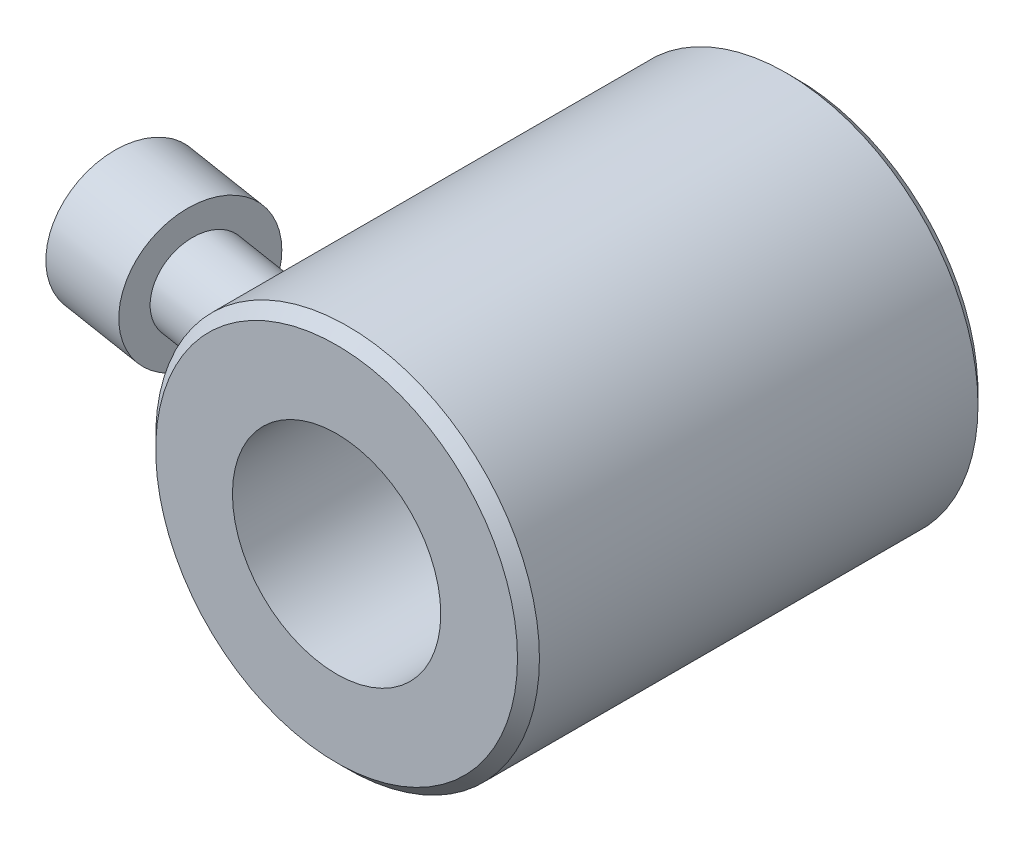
ISO-10303-21;
HEADER;
FILE_DESCRIPTION(('STEP AP214'),'2;1');
FILE_NAME('part.step','',(''),(''),'','','');
FILE_SCHEMA(('AUTOMOTIVE_DESIGN { 1 0 10303 214 1 1 1 1 }'));
ENDSEC;
DATA;
#1=APPLICATION_CONTEXT('core data for automotive mechanical design processes');
#2=APPLICATION_PROTOCOL_DEFINITION('international standard','automotive_design',2000,#1);
#3=PRODUCT_CONTEXT('',#1,'mechanical');
#4=PRODUCT('Part','Part','',(#3));
#5=PRODUCT_RELATED_PRODUCT_CATEGORY('part','',(#4));
#6=PRODUCT_DEFINITION_FORMATION('','',#4);
#7=PRODUCT_DEFINITION_CONTEXT('part definition',#1,'design');
#8=PRODUCT_DEFINITION('design','',#6,#7);
#9=PRODUCT_DEFINITION_SHAPE('','',#8);
#10=(LENGTH_UNIT() NAMED_UNIT(*) SI_UNIT(.MILLI.,.METRE.));
#11=(NAMED_UNIT(*) PLANE_ANGLE_UNIT() SI_UNIT($,.RADIAN.));
#12=(NAMED_UNIT(*) SI_UNIT($,.STERADIAN.) SOLID_ANGLE_UNIT());
#13=UNCERTAINTY_MEASURE_WITH_UNIT(LENGTH_MEASURE(1.E-05),#10,'distance_accuracy_value','');
#14=(GEOMETRIC_REPRESENTATION_CONTEXT(3) GLOBAL_UNCERTAINTY_ASSIGNED_CONTEXT((#13)) GLOBAL_UNIT_ASSIGNED_CONTEXT((#10,
#11,#12)) REPRESENTATION_CONTEXT('',''));
#15=CARTESIAN_POINT('',(0.,0.,0.));
#16=DIRECTION('',(0.,0.,1.));
#17=DIRECTION('',(1.,0.,0.));
#18=AXIS2_PLACEMENT_3D('',#15,#16,#17);
#19=CARTESIAN_POINT('',(-24.5233400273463,0.,8.88761222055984));
#20=DIRECTION('',(-0.987688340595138,0.,-0.156434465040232));
#21=DIRECTION('',(-0.156434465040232,0.,0.987688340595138));
#22=AXIS2_PLACEMENT_3D('',#19,#20,#21);
#23=CYLINDRICAL_SURFACE('',#22,1.25);
#24=CARTESIAN_POINT('',(-17.5,0.,11.265581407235));
#25=CARTESIAN_POINT('',(-17.4999994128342,0.0699765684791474,11.2655783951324));
#26=CARTESIAN_POINT('',(-17.499575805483,0.140001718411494,11.2596792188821));
#27=CARTESIAN_POINT('',(-17.4979265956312,0.278119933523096,11.2362271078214));
#28=CARTESIAN_POINT('',(-17.4967000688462,0.346210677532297,11.2186607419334));
#29=CARTESIAN_POINT('',(-17.493583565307,0.478441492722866,11.1723706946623));
#30=CARTESIAN_POINT('',(-17.491693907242,0.542583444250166,11.1436523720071));
#31=CARTESIAN_POINT('',(-17.4874637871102,0.665111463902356,11.0758775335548));
#32=CARTESIAN_POINT('',(-17.4851234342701,0.723498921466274,11.0368235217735));
#33=CARTESIAN_POINT('',(-17.4802526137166,0.832932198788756,10.9494526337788));
#34=CARTESIAN_POINT('',(-17.4777220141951,0.883972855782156,10.901129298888));
#35=CARTESIAN_POINT('',(-17.4727554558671,0.977243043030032,10.7966139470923));
#36=CARTESIAN_POINT('',(-17.4703195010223,1.01947220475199,10.7404216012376));
#37=CARTESIAN_POINT('',(-17.4658062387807,1.09408364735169,10.6215850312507));
#38=CARTESIAN_POINT('',(-17.4637300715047,1.1264348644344,10.5589212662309));
#39=CARTESIAN_POINT('',(-17.4601750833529,1.18026163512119,10.4290713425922));
#40=CARTESIAN_POINT('',(-17.458696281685,1.20173683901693,10.3618850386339));
#41=CARTESIAN_POINT('',(-17.4564876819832,1.23340768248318,10.22434920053));
#42=CARTESIAN_POINT('',(-17.4557637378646,1.24351521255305,10.1539792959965));
#43=CARTESIAN_POINT('',(-17.455160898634,1.25194887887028,10.0125341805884));
#44=CARTESIAN_POINT('',(-17.4552820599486,1.25027422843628,9.94145892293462));
#45=CARTESIAN_POINT('',(-17.456357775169,1.23516416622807,9.7997397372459));
#46=CARTESIAN_POINT('',(-17.4573220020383,1.22159224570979,9.72911043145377));
#47=CARTESIAN_POINT('',(-17.4599852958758,1.18291416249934,9.59109593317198));
#48=CARTESIAN_POINT('',(-17.4616844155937,1.15780717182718,9.52371097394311));
#49=CARTESIAN_POINT('',(-17.4656428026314,1.09648060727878,9.39349963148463));
#50=CARTESIAN_POINT('',(-17.467906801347,1.06016652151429,9.33071786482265));
#51=CARTESIAN_POINT('',(-17.4727286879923,0.977477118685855,9.21217909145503));
#52=CARTESIAN_POINT('',(-17.4752865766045,0.931101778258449,9.15642210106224));
#53=CARTESIAN_POINT('',(-17.4803911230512,0.829749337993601,9.05382068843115));
#54=CARTESIAN_POINT('',(-17.4829377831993,0.774808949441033,9.00694003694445));
#55=CARTESIAN_POINT('',(-17.4877346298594,0.65769619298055,8.9232805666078));
#56=CARTESIAN_POINT('',(-17.4899848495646,0.595524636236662,8.88650061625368));
#57=CARTESIAN_POINT('',(-17.4938841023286,0.466979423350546,8.82486405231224));
#58=CARTESIAN_POINT('',(-17.4955438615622,0.400709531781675,8.79979180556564));
#59=CARTESIAN_POINT('',(-17.498127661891,0.264837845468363,8.76139083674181));
#60=CARTESIAN_POINT('',(-17.4990518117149,0.195236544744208,8.74806037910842));
#61=CARTESIAN_POINT('',(-17.5000442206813,0.056317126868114,8.73376570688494));
#62=CARTESIAN_POINT('',(-17.5001308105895,-0.0129737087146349,8.73253663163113));
#63=CARTESIAN_POINT('',(-17.4994862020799,-0.150760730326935,8.74179567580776));
#64=CARTESIAN_POINT('',(-17.4987550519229,-0.219256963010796,8.75228310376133));
#65=CARTESIAN_POINT('',(-17.4965662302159,-0.353009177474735,8.78450143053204));
#66=CARTESIAN_POINT('',(-17.495113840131,-0.418284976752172,8.80615063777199));
#67=CARTESIAN_POINT('',(-17.4916459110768,-0.544337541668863,8.85994605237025));
#68=CARTESIAN_POINT('',(-17.4896303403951,-0.605114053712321,8.8920928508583));
#69=CARTESIAN_POINT('',(-17.4852257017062,-0.721326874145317,8.96638177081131));
#70=CARTESIAN_POINT('',(-17.482832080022,-0.77668264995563,9.00864950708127));
#71=CARTESIAN_POINT('',(-17.4779512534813,-0.879707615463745,9.1016897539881));
#72=CARTESIAN_POINT('',(-17.4754640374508,-0.927375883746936,9.15246328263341));
#73=CARTESIAN_POINT('',(-17.4706071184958,-1.01481668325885,9.26232481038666));
#74=CARTESIAN_POINT('',(-17.4682413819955,-1.05438466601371,9.32157583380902));
#75=CARTESIAN_POINT('',(-17.4639515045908,-1.12320577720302,9.44580882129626));
#76=CARTESIAN_POINT('',(-17.4620274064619,-1.15245790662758,9.51079133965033));
#77=CARTESIAN_POINT('',(-17.4588083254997,-1.20024948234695,9.64576831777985));
#78=CARTESIAN_POINT('',(-17.4575238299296,-1.21861123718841,9.71582603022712));
#79=CARTESIAN_POINT('',(-17.4557794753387,-1.24334983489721,9.85803888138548));
#80=CARTESIAN_POINT('',(-17.4553196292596,-1.24972648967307,9.93019405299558));
#81=CARTESIAN_POINT('',(-17.4552817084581,-1.25025635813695,10.074589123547));
#82=CARTESIAN_POINT('',(-17.4557040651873,-1.24440359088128,10.1468290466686));
#83=CARTESIAN_POINT('',(-17.4573880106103,-1.22055111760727,10.2892664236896));
#84=CARTESIAN_POINT('',(-17.4586495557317,-1.20255204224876,10.359463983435));
#85=CARTESIAN_POINT('',(-17.4618527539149,-1.15509903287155,10.4950465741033));
#86=CARTESIAN_POINT('',(-17.4637872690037,-1.12576497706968,10.5604737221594));
#87=CARTESIAN_POINT('',(-17.468118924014,-1.05641964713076,10.6853819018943));
#88=CARTESIAN_POINT('',(-17.4705160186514,-1.0164094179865,10.7448635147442));
#89=CARTESIAN_POINT('',(-17.4754688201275,-0.927335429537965,10.8555034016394));
#90=CARTESIAN_POINT('',(-17.478022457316,-0.878377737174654,10.906747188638));
#91=CARTESIAN_POINT('',(-17.4830223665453,-0.772484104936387,11.0002313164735));
#92=CARTESIAN_POINT('',(-17.485468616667,-0.715546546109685,11.0424698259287));
#93=CARTESIAN_POINT('',(-17.489960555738,-0.595694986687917,11.1164855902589));
#94=CARTESIAN_POINT('',(-17.4920085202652,-0.532818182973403,11.1483230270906));
#95=CARTESIAN_POINT('',(-17.4954880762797,-0.402639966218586,11.2009432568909));
#96=CARTESIAN_POINT('',(-17.4969203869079,-0.335343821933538,11.2217389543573));
#97=CARTESIAN_POINT('',(-17.498633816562,-0.223033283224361,11.2463180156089));
#98=CARTESIAN_POINT('',(-17.4991438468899,-0.178743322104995,11.2535325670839));
#99=CARTESIAN_POINT('',(-17.4998271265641,-0.0896422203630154,11.2631652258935));
#100=CARTESIAN_POINT('',(-17.5000003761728,-0.0448310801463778,11.265583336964));
#101=CARTESIAN_POINT('',(-17.5,0.,11.265581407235));
#102=B_SPLINE_CURVE_WITH_KNOTS('',3,(#24,#25,#26,#27,#28,#29,#30,#31,#32,#33,#34,#35,#36,#37,
#38,#39,#40,#41,#42,#43,#44,#45,#46,#47,#48,#49,#50,#51,#52,#53,#54,#55,#56,#57,#58,#59,#60,#61,
#62,#63,#64,#65,#66,#67,#68,#69,#70,#71,#72,#73,#74,#75,#76,#77,#78,#79,#80,#81,#82,#83,#84,#85,
#86,#87,#88,#89,#90,#91,#92,#93,#94,#95,#96,#97,#98,#99,#100,#101),.UNSPECIFIED.,.T.,.F.,(4,2,2,
2,2,2,2,2,2,2,2,2,2,2,2,2,2,2,2,2,2,2,2,2,2,2,2,2,2,2,2,2,2,2,2,2,2,2,4),(0.,0.209766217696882,
0.419774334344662,0.629681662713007,0.83953818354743,1.04954146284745,1.25955352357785,
1.47021937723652,1.68089200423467,1.89318651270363,2.1054951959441,2.32027226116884,
2.53506474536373,2.75172054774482,2.96837685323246,3.1841288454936,3.39985665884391,
3.61143708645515,3.82298623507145,4.02989467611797,4.23679090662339,4.44219394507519,
4.64760855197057,4.85571841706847,5.06385320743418,5.27672821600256,5.48962383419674,
5.70590384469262,5.9221872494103,6.13857645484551,6.35495442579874,6.56910400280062,
6.78323262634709,6.99497057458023,7.20675154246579,7.41728447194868,7.62757080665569,
7.76195941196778,7.89634791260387),.UNSPECIFIED.);
#103=CARTESIAN_POINT('',(-17.5,0.,11.265581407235));
#104=VERTEX_POINT('',#103);
#105=EDGE_CURVE('E175',#104,#104,#102,.T.);
#106=ORIENTED_EDGE('',*,*,#105,.T.);
#107=EDGE_LOOP('',(#106));
#108=FACE_BOUND('',#107,.T.);
#109=CARTESIAN_POINT('',(-16.5,0.,11.4239658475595));
#110=CARTESIAN_POINT('',(-16.4999993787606,0.0699951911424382,11.423962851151));
#111=CARTESIAN_POINT('',(-16.4995498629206,0.140038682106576,11.418064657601));
#112=CARTESIAN_POINT('',(-16.4977997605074,0.278193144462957,11.3946158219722));
#113=CARTESIAN_POINT('',(-16.4964981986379,0.346301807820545,11.3770518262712));
#114=CARTESIAN_POINT('',(-16.4931909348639,0.478568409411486,11.3307654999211));
#115=CARTESIAN_POINT('',(-16.4911855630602,0.54272818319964,11.3020483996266));
#116=CARTESIAN_POINT('',(-16.4866963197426,0.665289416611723,11.2342721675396));
#117=CARTESIAN_POINT('',(-16.4842125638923,0.72369226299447,11.1952155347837));
#118=CARTESIAN_POINT('',(-16.479043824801,0.833140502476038,11.1078416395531));
#119=CARTESIAN_POINT('',(-16.4763587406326,0.884182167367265,11.0595197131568));
#120=CARTESIAN_POINT('',(-16.4710892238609,0.977449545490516,10.955002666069));
#121=CARTESIAN_POINT('',(-16.4685047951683,1.01967491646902,10.8988072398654));
#122=CARTESIAN_POINT('',(-16.4637180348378,1.09425495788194,10.7799868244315));
#123=CARTESIAN_POINT('',(-16.4615167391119,1.12658304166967,10.7173451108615));
#124=CARTESIAN_POINT('',(-16.4577479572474,1.1803655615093,10.5875403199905));
#125=CARTESIAN_POINT('',(-16.4561804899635,1.20181967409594,10.520377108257));
#126=CARTESIAN_POINT('',(-16.4538404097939,1.23344713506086,10.3829105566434));
#127=CARTESIAN_POINT('',(-16.4530737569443,1.24353594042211,10.312587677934));
#128=CARTESIAN_POINT('',(-16.452435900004,1.25194682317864,10.1712385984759));
#129=CARTESIAN_POINT('',(-16.4525647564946,1.25026810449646,10.1002123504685));
#130=CARTESIAN_POINT('',(-16.453705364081,1.23516681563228,9.95857316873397));
#131=CARTESIAN_POINT('',(-16.4547275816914,1.22160501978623,9.88797515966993));
#132=CARTESIAN_POINT('',(-16.4575505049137,1.18296378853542,9.75001864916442));
#133=CARTESIAN_POINT('',(-16.4593512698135,1.15788347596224,9.68266039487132));
#134=CARTESIAN_POINT('',(-16.4635477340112,1.09660564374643,9.55244569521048));
#135=CARTESIAN_POINT('',(-16.4659488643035,1.06030588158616,9.48963749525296));
#136=CARTESIAN_POINT('',(-16.4710630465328,0.977645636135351,9.37104087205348));
#137=CARTESIAN_POINT('',(-16.4737761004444,0.931285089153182,9.31525249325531));
#138=CARTESIAN_POINT('',(-16.4791919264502,0.829935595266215,9.21255969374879));
#139=CARTESIAN_POINT('',(-16.4818946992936,0.774979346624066,9.16562303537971));
#140=CARTESIAN_POINT('',(-16.4869858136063,0.657821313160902,9.08185948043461));
#141=CARTESIAN_POINT('',(-16.4893741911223,0.595620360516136,9.04503142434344));
#142=CARTESIAN_POINT('',(-16.493511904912,0.467030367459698,8.9833275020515));
#143=CARTESIAN_POINT('',(-16.4952728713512,0.400747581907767,8.95823108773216));
#144=CARTESIAN_POINT('',(-16.4980141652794,0.264842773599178,8.91979335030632));
#145=CARTESIAN_POINT('',(-16.4989946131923,0.195221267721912,8.90645021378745));
#146=CARTESIAN_POINT('',(-16.5000467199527,0.0563212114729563,8.89215223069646));
#147=CARTESIAN_POINT('',(-16.5001386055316,-0.0129289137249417,8.89092164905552));
#148=CARTESIAN_POINT('',(-16.4994560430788,-0.150634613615,8.90017172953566));
#149=CARTESIAN_POINT('',(-16.4986816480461,-0.219090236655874,8.91065167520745));
#150=CARTESIAN_POINT('',(-16.4963635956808,-0.352739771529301,8.94284166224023));
#151=CARTESIAN_POINT('',(-16.4948257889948,-0.417954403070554,8.9644663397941));
#152=CARTESIAN_POINT('',(-16.4911538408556,-0.543891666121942,9.01819495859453));
#153=CARTESIAN_POINT('',(-16.4890196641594,-0.604614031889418,9.05029951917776));
#154=CARTESIAN_POINT('',(-16.4843540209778,-0.7207646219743,9.12450590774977));
#155=CARTESIAN_POINT('',(-16.4818175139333,-0.776108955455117,9.16673862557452));
#156=CARTESIAN_POINT('',(-16.4766443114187,-0.879123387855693,9.25970081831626));
#157=CARTESIAN_POINT('',(-16.4740076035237,-0.926792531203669,9.310431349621));
#158=CARTESIAN_POINT('',(-16.4688551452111,-1.01428840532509,9.42024608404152));
#159=CARTESIAN_POINT('',(-16.4663437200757,-1.05390341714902,9.47949923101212));
#160=CARTESIAN_POINT('',(-16.4617881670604,-1.12282128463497,9.6037445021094));
#161=CARTESIAN_POINT('',(-16.4597440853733,-1.15212312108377,9.66873719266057));
#162=CARTESIAN_POINT('',(-16.4563222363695,-1.20002019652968,9.80375911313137));
#163=CARTESIAN_POINT('',(-16.454955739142,-1.21843526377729,9.87385263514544));
#164=CARTESIAN_POINT('',(-16.4530980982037,-1.24326996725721,10.0161472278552));
#165=CARTESIAN_POINT('',(-16.4526069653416,-1.24968945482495,10.0883483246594));
#166=CARTESIAN_POINT('',(-16.452561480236,-1.25028845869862,10.232800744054));
#167=CARTESIAN_POINT('',(-16.4530070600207,-1.24446886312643,10.3050520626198));
#168=CARTESIAN_POINT('',(-16.4547893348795,-1.22067544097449,10.4475151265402));
#169=CARTESIAN_POINT('',(-16.4561259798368,-1.20270229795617,10.5177269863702));
#170=CARTESIAN_POINT('',(-16.4595206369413,-1.15530702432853,10.653292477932));
#171=CARTESIAN_POINT('',(-16.4615705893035,-1.12601242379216,10.718690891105));
#172=CARTESIAN_POINT('',(-16.4661615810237,-1.0567505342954,10.8435466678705));
#173=CARTESIAN_POINT('',(-16.4687025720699,-1.01678429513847,10.9030046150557));
#174=CARTESIAN_POINT('',(-16.4739531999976,-0.92780591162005,11.0135997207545));
#175=CARTESIAN_POINT('',(-16.4766606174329,-0.878900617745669,11.0648229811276));
#176=CARTESIAN_POINT('',(-16.4819625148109,-0.77311670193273,11.1582786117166));
#177=CARTESIAN_POINT('',(-16.4845569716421,-0.716236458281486,11.2005091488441));
#178=CARTESIAN_POINT('',(-16.4893232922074,-0.596478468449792,11.274540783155));
#179=CARTESIAN_POINT('',(-16.4914974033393,-0.533635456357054,11.3063980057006));
#180=CARTESIAN_POINT('',(-16.495192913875,-0.403520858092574,11.3590703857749));
#181=CARTESIAN_POINT('',(-16.4967150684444,-0.336254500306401,11.379898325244));
#182=CARTESIAN_POINT('',(-16.4985407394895,-0.223821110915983,11.4045783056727));
#183=CARTESIAN_POINT('',(-16.4990855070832,-0.179376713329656,11.411839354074));
#184=CARTESIAN_POINT('',(-16.4998153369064,-0.0899615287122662,11.4215340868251));
#185=CARTESIAN_POINT('',(-16.5000003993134,-0.044990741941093,11.4239677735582));
#186=CARTESIAN_POINT('',(-16.5,0.,11.4239658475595));
#187=B_SPLINE_CURVE_WITH_KNOTS('',3,(#109,#110,#111,#112,#113,#114,#115,#116,#117,#118,#119,
#120,#121,#122,#123,#124,#125,#126,#127,#128,#129,#130,#131,#132,#133,#134,#135,#136,#137,#138,
#139,#140,#141,#142,#143,#144,#145,#146,#147,#148,#149,#150,#151,#152,#153,#154,#155,#156,#157,
#158,#159,#160,#161,#162,#163,#164,#165,#166,#167,#168,#169,#170,#171,#172,#173,#174,#175,#176,
#177,#178,#179,#180,#181,#182,#183,#184,#185,#186),.UNSPECIFIED.,.T.,.F.,(4,2,2,2,2,2,2,2,2,2,2,
2,2,2,2,2,2,2,2,2,2,2,2,2,2,2,2,2,2,2,2,2,2,2,2,2,2,2,4),(0.,0.209821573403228,
0.419883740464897,0.62984751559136,0.839760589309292,1.04977960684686,1.25980677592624,
1.47039327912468,1.68098604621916,1.89313521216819,2.10529873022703,2.31998176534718,
2.53468115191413,2.75139784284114,2.9681159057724,3.1840287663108,3.39991685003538,
3.61156462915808,3.8231797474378,4.02996611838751,4.2367398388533,4.44195279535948,
4.64717788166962,4.85521349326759,5.06327498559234,5.27624854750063,5.4892431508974,
5.70567062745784,5.92210078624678,6.13851524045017,6.35491752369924,6.56895004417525,
6.78296151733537,6.99456480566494,7.20621118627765,7.41669264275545,7.62692963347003,
7.76179651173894,7.89666332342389),.UNSPECIFIED.);
#188=CARTESIAN_POINT('',(-16.5,0.,11.4239658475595));
#189=VERTEX_POINT('',#188);
#190=EDGE_CURVE('E9',#189,#189,#187,.T.);
#191=ORIENTED_EDGE('',*,*,#190,.F.);
#192=EDGE_LOOP('',(#191));
#193=FACE_BOUND('',#192,.T.);
#194=ADVANCED_FACE('F15',(#108,#193),#23,.F.);
#195=CARTESIAN_POINT('',(1.,-15.,26.4226497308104));
#196=DIRECTION('',(1.,0.,0.));
#197=DIRECTION('',(0.,1.,0.));
#198=AXIS2_PLACEMENT_3D('',#195,#196,#197);
#199=PLANE('',#198);
#200=DIRECTION('',(0.,0.,-1.));
#201=VECTOR('',#200,1.);
#202=CARTESIAN_POINT('',(1.,-16.4696690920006,0.));
#203=LINE('',#202,#201);
#204=CARTESIAN_POINT('',(1.,-16.4696690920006,26.4226497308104));
#205=VERTEX_POINT('',#204);
#206=CARTESIAN_POINT('',(1.,-16.4696690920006,27.5773502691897));
#207=VERTEX_POINT('',#206);
#208=EDGE_CURVE('E280',#205,#207,#203,.F.);
#209=ORIENTED_EDGE('',*,*,#208,.F.);
#210=DIRECTION('',(0.,-1.,0.));
#211=VECTOR('',#210,1.);
#212=CARTESIAN_POINT('',(1.,-15.,26.4226497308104));
#213=LINE('',#212,#211);
#214=CARTESIAN_POINT('',(1.,-16.5,26.4226497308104));
#215=VERTEX_POINT('',#214);
#216=EDGE_CURVE('E268',#205,#215,#213,.T.);
#217=ORIENTED_EDGE('',*,*,#216,.T.);
#218=DIRECTION('',(0.,0.,1.));
#219=VECTOR('',#218,1.);
#220=CARTESIAN_POINT('',(1.,-16.5,26.4226497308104));
#221=LINE('',#220,#219);
#222=CARTESIAN_POINT('',(1.,-16.5,27.5773502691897));
#223=VERTEX_POINT('',#222);
#224=EDGE_CURVE('E113',#215,#223,#221,.T.);
#225=ORIENTED_EDGE('',*,*,#224,.T.);
#226=DIRECTION('',(0.,-1.,0.));
#227=VECTOR('',#226,1.);
#228=CARTESIAN_POINT('',(1.,-15.,27.5773502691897));
#229=LINE('',#228,#227);
#230=EDGE_CURVE('E176',#207,#223,#229,.T.);
#231=ORIENTED_EDGE('',*,*,#230,.F.);
#232=EDGE_LOOP('',(#209,#217,#225,#231));
#233=FACE_BOUND('',#232,.T.);
#234=ADVANCED_FACE('F226',(#233),#199,.F.);
#235=CARTESIAN_POINT('',(-1.,-15.,27.5773502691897));
#236=DIRECTION('',(-1.,0.,0.));
#237=DIRECTION('',(0.,0.,-1.));
#238=AXIS2_PLACEMENT_3D('',#235,#236,#237);
#239=PLANE('',#238);
#240=DIRECTION('',(0.,0.,-1.));
#241=VECTOR('',#240,1.);
#242=CARTESIAN_POINT('',(-1.,-16.4696690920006,0.));
#243=LINE('',#242,#241);
#244=CARTESIAN_POINT('',(-1.,-16.4696690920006,27.5773502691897));
#245=VERTEX_POINT('',#244);
#246=CARTESIAN_POINT('',(-1.,-16.4696690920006,26.4226497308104));
#247=VERTEX_POINT('',#246);
#248=EDGE_CURVE('E117',#245,#247,#243,.T.);
#249=ORIENTED_EDGE('',*,*,#248,.F.);
#250=DIRECTION('',(0.,-1.,0.));
#251=VECTOR('',#250,1.);
#252=CARTESIAN_POINT('',(-1.,-15.,27.5773502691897));
#253=LINE('',#252,#251);
#254=CARTESIAN_POINT('',(-1.,-16.5,27.5773502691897));
#255=VERTEX_POINT('',#254);
#256=EDGE_CURVE('E102',#245,#255,#253,.T.);
#257=ORIENTED_EDGE('',*,*,#256,.T.);
#258=DIRECTION('',(0.,0.,-1.));
#259=VECTOR('',#258,1.);
#260=CARTESIAN_POINT('',(-1.,-16.5,27.5773502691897));
#261=LINE('',#260,#259);
#262=CARTESIAN_POINT('',(-1.,-16.5,26.4226497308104));
#263=VERTEX_POINT('',#262);
#264=EDGE_CURVE('E257',#255,#263,#261,.T.);
#265=ORIENTED_EDGE('',*,*,#264,.T.);
#266=DIRECTION('',(0.,-1.,0.));
#267=VECTOR('',#266,1.);
#268=CARTESIAN_POINT('',(-1.,-15.,26.4226497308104));
#269=LINE('',#268,#267);
#270=EDGE_CURVE('E112',#247,#263,#269,.T.);
#271=ORIENTED_EDGE('',*,*,#270,.F.);
#272=EDGE_LOOP('',(#249,#257,#265,#271));
#273=FACE_BOUND('',#272,.T.);
#274=ADVANCED_FACE('F118',(#273),#239,.F.);
#275=CARTESIAN_POINT('',(-7.7644177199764,0.,30.041964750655));
#276=DIRECTION('',(0.987688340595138,0.,0.156434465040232));
#277=DIRECTION('',(0.156434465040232,0.,-0.987688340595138));
#278=AXIS2_PLACEMENT_3D('',#275,#276,#277);
#279=CYLINDRICAL_SURFACE('',#278,4.);
#280=CARTESIAN_POINT('',(-17.5,0.,32.549860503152));
#281=CARTESIAN_POINT('',(-17.4999957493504,0.22461447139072,32.5498539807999));
#282=CARTESIAN_POINT('',(-17.4956327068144,0.449318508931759,32.5313396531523));
#283=CARTESIAN_POINT('',(-17.4786392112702,0.892435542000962,32.4577221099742));
#284=CARTESIAN_POINT('',(-17.466003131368,1.11084415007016,32.4025939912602));
#285=CARTESIAN_POINT('',(-17.4338463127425,1.53500330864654,32.2571782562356));
#286=CARTESIAN_POINT('',(-17.4143281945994,1.74075864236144,32.1669040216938));
#287=CARTESIAN_POINT('',(-17.3705421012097,2.13387663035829,31.9534994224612));
#288=CARTESIAN_POINT('',(-17.3462746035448,2.3212411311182,31.8303723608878));
#289=CARTESIAN_POINT('',(-17.2956371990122,2.67254969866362,31.554214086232));
#290=CARTESIAN_POINT('',(-17.2692645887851,2.8364628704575,31.4011440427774));
#291=CARTESIAN_POINT('',(-17.2174178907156,3.13586762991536,31.0692182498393));
#292=CARTESIAN_POINT('',(-17.1919437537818,3.27136077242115,30.890363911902));
#293=CARTESIAN_POINT('',(-17.1450047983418,3.50904954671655,30.5132847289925));
#294=CARTESIAN_POINT('',(-17.1235096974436,3.61150148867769,30.3152252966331));
#295=CARTESIAN_POINT('',(-17.0867315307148,3.78169775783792,29.9041969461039));
#296=CARTESIAN_POINT('',(-17.071447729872,3.84944619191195,29.6912297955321));
#297=CARTESIAN_POINT('',(-17.0489280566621,3.94798646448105,29.2592561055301));
#298=CARTESIAN_POINT('',(-17.0415966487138,3.97921736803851,29.0403543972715));
#299=CARTESIAN_POINT('',(-17.0353528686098,4.0058631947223,28.6002825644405));
#300=CARTESIAN_POINT('',(-17.0364409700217,4.00127610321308,28.3791123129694));
#301=CARTESIAN_POINT('',(-17.0468237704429,3.95680559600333,27.9380003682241));
#302=CARTESIAN_POINT('',(-17.0562129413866,3.91651584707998,27.7181022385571));
#303=CARTESIAN_POINT('',(-17.0821528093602,3.80177307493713,27.287851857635));
#304=CARTESIAN_POINT('',(-17.0987051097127,3.72731240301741,27.0775017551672));
#305=CARTESIAN_POINT('',(-17.1378795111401,3.54292035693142,26.6635686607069));
#306=CARTESIAN_POINT('',(-17.1607139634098,3.43171388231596,26.460573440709));
#307=CARTESIAN_POINT('',(-17.2095501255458,3.17774497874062,26.0757614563));
#308=CARTESIAN_POINT('',(-17.2355525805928,3.03497511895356,25.8939496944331));
#309=CARTESIAN_POINT('',(-17.2885137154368,2.71731655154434,25.5523458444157));
#310=CARTESIAN_POINT('',(-17.3154801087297,2.54171848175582,25.3932124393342));
#311=CARTESIAN_POINT('',(-17.3665728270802,2.16521302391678,25.1077562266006));
#312=CARTESIAN_POINT('',(-17.3906996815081,1.96431036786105,24.981427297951));
#313=CARTESIAN_POINT('',(-17.4324970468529,1.54923721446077,24.7698430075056));
#314=CARTESIAN_POINT('',(-17.4503460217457,1.33567891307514,24.6834256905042));
#315=CARTESIAN_POINT('',(-17.4784212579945,0.896184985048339,24.5497264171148));
#316=CARTESIAN_POINT('',(-17.4886512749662,0.670255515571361,24.5024251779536));
#317=CARTESIAN_POINT('',(-17.4998301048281,0.227725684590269,24.4508532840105));
#318=CARTESIAN_POINT('',(-17.5013210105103,0.0114294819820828,24.4440688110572));
#319=CARTESIAN_POINT('',(-17.4963048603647,-0.419085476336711,24.4671089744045));
#320=CARTESIAN_POINT('',(-17.489799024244,-0.633304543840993,24.4969280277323));
#321=CARTESIAN_POINT('',(-17.4697946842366,-1.04801423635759,24.5906483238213));
#322=CARTESIAN_POINT('',(-17.4564779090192,-1.24871532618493,24.6536650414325));
#323=CARTESIAN_POINT('',(-17.4243532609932,-1.63704573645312,24.8108094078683));
#324=CARTESIAN_POINT('',(-17.4055445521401,-1.8246730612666,24.9049417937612));
#325=CARTESIAN_POINT('',(-17.3635294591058,-2.18924524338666,25.1252195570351));
#326=CARTESIAN_POINT('',(-17.3401852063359,-2.36553057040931,25.2524280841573));
#327=CARTESIAN_POINT('',(-17.2919524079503,-2.6956001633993,25.5330478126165));
#328=CARTESIAN_POINT('',(-17.2670633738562,-2.84937725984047,25.6864673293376));
#329=CARTESIAN_POINT('',(-17.2166804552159,-3.13990421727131,26.0255416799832));
#330=CARTESIAN_POINT('',(-17.1912429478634,-3.27503349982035,26.2125956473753));
#331=CARTESIAN_POINT('',(-17.144170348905,-3.51314694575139,26.6066225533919));
#332=CARTESIAN_POINT('',(-17.1225360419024,-3.6161244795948,26.8135995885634));
#333=CARTESIAN_POINT('',(-17.0850498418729,-3.78935161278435,27.2478052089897));
#334=CARTESIAN_POINT('',(-17.0693664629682,-3.85866112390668,27.4754252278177));
#335=CARTESIAN_POINT('',(-17.046655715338,-3.95779784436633,27.9395346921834));
#336=CARTESIAN_POINT('',(-17.0396266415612,-3.98763283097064,28.176022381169));
#337=CARTESIAN_POINT('',(-17.0353470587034,-4.00587500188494,28.6441743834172));
#338=CARTESIAN_POINT('',(-17.0378324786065,-3.9954009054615,28.875792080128));
#339=CARTESIAN_POINT('',(-17.0518556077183,-3.93512027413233,29.3335629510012));
#340=CARTESIAN_POINT('',(-17.0633912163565,-3.88532286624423,29.559717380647));
#341=CARTESIAN_POINT('',(-17.0936083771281,-3.75008091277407,29.9911728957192));
#342=CARTESIAN_POINT('',(-17.1120042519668,-3.66605044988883,30.1969386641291));
#343=CARTESIAN_POINT('',(-17.1538823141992,-3.46479928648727,30.5909656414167));
#344=CARTESIAN_POINT('',(-17.1773642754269,-3.34758006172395,30.7792276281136));
#345=CARTESIAN_POINT('',(-17.2266034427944,-3.08413874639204,31.131891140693));
#346=CARTESIAN_POINT('',(-17.2523445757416,-2.93811357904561,31.2964422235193));
#347=CARTESIAN_POINT('',(-17.3034160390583,-2.6206100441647,31.5989454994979));
#348=CARTESIAN_POINT('',(-17.3287462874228,-2.44912666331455,31.7368924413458));
#349=CARTESIAN_POINT('',(-17.3765824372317,-2.08299901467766,31.9843622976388));
#350=CARTESIAN_POINT('',(-17.3990460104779,-1.88807553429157,32.0934801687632));
#351=CARTESIAN_POINT('',(-17.4382827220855,-1.48246254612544,32.2780292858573));
#352=CARTESIAN_POINT('',(-17.4550595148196,-1.27178326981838,32.3534821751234));
#353=CARTESIAN_POINT('',(-17.4784899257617,-0.8843707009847,32.4571671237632));
#354=CARTESIAN_POINT('',(-17.4865066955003,-0.709420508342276,32.4918731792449));
#355=CARTESIAN_POINT('',(-17.4972634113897,-0.356332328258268,32.5382224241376));
#356=CARTESIAN_POINT('',(-17.5000033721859,-0.178194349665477,32.5498656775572));
#357=CARTESIAN_POINT('',(-17.5,0.,32.549860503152));
#358=B_SPLINE_CURVE_WITH_KNOTS('',3,(#280,#281,#282,#283,#284,#285,#286,#287,#288,#289,#290,
#291,#292,#293,#294,#295,#296,#297,#298,#299,#300,#301,#302,#303,#304,#305,#306,#307,#308,#309,
#310,#311,#312,#313,#314,#315,#316,#317,#318,#319,#320,#321,#322,#323,#324,#325,#326,#327,#328,
#329,#330,#331,#332,#333,#334,#335,#336,#337,#338,#339,#340,#341,#342,#343,#344,#345,#346,#347,
#348,#349,#350,#351,#352,#353,#354,#355,#356,#357),.UNSPECIFIED.,.T.,.F.,(4,2,2,2,2,2,2,2,2,2,2,
2,2,2,2,2,2,2,2,2,2,2,2,2,2,2,2,2,2,2,2,2,2,2,2,2,2,2,4),(0.,0.673201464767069,1.34686128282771,
2.02026485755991,2.6936007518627,3.36781569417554,4.0419937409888,4.71080864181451,
5.37954437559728,6.04015414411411,6.70080106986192,7.36906481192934,8.03747820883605,
8.73207239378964,9.42683027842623,10.1388354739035,10.8507077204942,11.5402958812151,
12.2295438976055,12.8755434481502,13.5214444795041,14.150946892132,14.7805451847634,
15.433628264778,16.0869189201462,16.7802373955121,17.4736987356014,18.1855455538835,
18.8972521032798,19.5893506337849,20.2812885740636,20.9471508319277,21.61298348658,
22.2744129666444,22.9359728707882,23.6063851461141,24.2763657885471,24.8104410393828,
25.3445148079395),.UNSPECIFIED.);
#359=CARTESIAN_POINT('',(-17.5,0.,32.549860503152));
#360=VERTEX_POINT('',#359);
#361=EDGE_CURVE('E194',#360,#360,#358,.T.);
#362=ORIENTED_EDGE('',*,*,#361,.T.);
#363=EDGE_LOOP('',(#362));
#364=FACE_BOUND('',#363,.T.);
#365=CARTESIAN_POINT('',(-27.5181845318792,0.,26.9132754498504));
#366=DIRECTION('',(0.987688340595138,0.,0.156434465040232));
#367=DIRECTION('',(0.156434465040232,0.,-0.987688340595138));
#368=AXIS2_PLACEMENT_3D('',#365,#366,#367);
#369=CIRCLE('',#368,4.);
#370=CARTESIAN_POINT('',(-26.8924466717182,0.,22.9625220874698));
#371=VERTEX_POINT('',#370);
#372=EDGE_CURVE('E127',#371,#371,#369,.T.);
#373=ORIENTED_EDGE('',*,*,#372,.T.);
#374=EDGE_LOOP('',(#373));
#375=FACE_BOUND('',#374,.T.);
#376=ADVANCED_FACE('F17',(#364,#375),#279,.T.);
#377=CARTESIAN_POINT('',(-26.8924466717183,0.,22.9625220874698));
#378=DIRECTION('',(0.987688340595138,0.,0.156434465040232));
#379=DIRECTION('',(0.156434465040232,0.,-0.987688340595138));
#380=AXIS2_PLACEMENT_3D('',#377,#378,#379);
#381=PLANE('',#380);
#382=CARTESIAN_POINT('',(-27.5181845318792,0.,26.9132754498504));
#383=DIRECTION('',(0.987688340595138,0.,0.156434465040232));
#384=DIRECTION('',(0.156434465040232,0.,-0.987688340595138));
#385=AXIS2_PLACEMENT_3D('',#382,#383,#384);
#386=CIRCLE('',#385,6.5);
#387=CARTESIAN_POINT('',(-26.5013605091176,0.,20.493301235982));
#388=VERTEX_POINT('',#387);
#389=EDGE_CURVE('E130',#388,#388,#386,.T.);
#390=ORIENTED_EDGE('',*,*,#389,.T.);
#391=EDGE_LOOP('',(#390));
#392=FACE_BOUND('',#391,.T.);
#393=ORIENTED_EDGE('',*,*,#372,.F.);
#394=EDGE_LOOP('',(#393));
#395=FACE_BOUND('',#394,.T.);
#396=ADVANCED_FACE('F347',(#392,#395),#381,.T.);
#397=CARTESIAN_POINT('',(-7.7644177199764,0.,30.041964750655));
#398=DIRECTION('',(0.987688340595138,0.,0.156434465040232));
#399=DIRECTION('',(0.156434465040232,0.,-0.987688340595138));
#400=AXIS2_PLACEMENT_3D('',#397,#398,#399);
#401=CYLINDRICAL_SURFACE('',#400,6.5);
#402=CARTESIAN_POINT('',(-35.4196912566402,0.,25.6617997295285));
#403=DIRECTION('',(0.987688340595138,0.,0.156434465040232));
#404=DIRECTION('',(0.156434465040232,0.,-0.987688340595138));
#405=AXIS2_PLACEMENT_3D('',#402,#403,#404);
#406=CIRCLE('',#405,6.5);
#407=CARTESIAN_POINT('',(-34.4028672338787,0.,19.2418255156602));
#408=VERTEX_POINT('',#407);
#409=EDGE_CURVE('E564',#408,#408,#406,.T.);
#410=ORIENTED_EDGE('',*,*,#409,.T.);
#411=EDGE_LOOP('',(#410));
#412=FACE_BOUND('',#411,.T.);
#413=ORIENTED_EDGE('',*,*,#389,.F.);
#414=EDGE_LOOP('',(#413));
#415=FACE_BOUND('',#414,.T.);
#416=ADVANCED_FACE('F355',(#412,#415),#401,.T.);
#417=CARTESIAN_POINT('',(-34.4028672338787,0.,19.2418255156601));
#418=DIRECTION('',(-0.987688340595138,0.,-0.156434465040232));
#419=DIRECTION('',(-0.156434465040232,0.,0.987688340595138));
#420=AXIS2_PLACEMENT_3D('',#417,#418,#419);
#421=PLANE('',#420);
#422=DIRECTION('',(-0.135476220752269,-0.5,0.855363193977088));
#423=VECTOR('',#422,1.);
#424=CARTESIAN_POINT('',(-34.9503878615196,-1.73205080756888,22.6987347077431));
#425=LINE('',#424,#423);
#426=CARTESIAN_POINT('',(-34.9503878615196,-1.73205080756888,22.6987347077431));
#427=VERTEX_POINT('',#426);
#428=CARTESIAN_POINT('',(-35.4196912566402,-3.46410161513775,25.6617997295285));
#429=VERTEX_POINT('',#428);
#430=EDGE_CURVE('E516',#427,#429,#425,.T.);
#431=ORIENTED_EDGE('',*,*,#430,.F.);
#432=DIRECTION('',(0.,-1.,0.));
#433=VECTOR('',#432,1.);
#434=CARTESIAN_POINT('',(-34.9503878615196,1.73205080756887,22.6987347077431));
#435=LINE('',#434,#433);
#436=CARTESIAN_POINT('',(-34.9503878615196,1.73205080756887,22.6987347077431));
#437=VERTEX_POINT('',#436);
#438=EDGE_CURVE('E530',#437,#427,#435,.T.);
#439=ORIENTED_EDGE('',*,*,#438,.F.);
#440=DIRECTION('',(-0.135476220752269,0.5,0.855363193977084));
#441=VECTOR('',#440,1.);
#442=CARTESIAN_POINT('',(-34.9503878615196,1.73205080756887,22.6987347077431));
#443=LINE('',#442,#441);
#444=CARTESIAN_POINT('',(-35.4196912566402,3.46410161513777,25.6617997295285));
#445=VERTEX_POINT('',#444);
#446=EDGE_CURVE('E527',#437,#445,#443,.T.);
#447=ORIENTED_EDGE('',*,*,#446,.T.);
#448=DIRECTION('',(0.135476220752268,0.5,-0.855363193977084));
#449=VECTOR('',#448,1.);
#450=CARTESIAN_POINT('',(-35.888994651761,1.73205080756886,28.6248647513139));
#451=LINE('',#450,#449);
#452=CARTESIAN_POINT('',(-35.888994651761,1.73205080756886,28.6248647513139));
#453=VERTEX_POINT('',#452);
#454=EDGE_CURVE('E524',#453,#445,#451,.T.);
#455=ORIENTED_EDGE('',*,*,#454,.F.);
#456=DIRECTION('',(0.,-1.,0.));
#457=VECTOR('',#456,1.);
#458=CARTESIAN_POINT('',(-35.888994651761,1.73205080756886,28.6248647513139));
#459=LINE('',#458,#457);
#460=CARTESIAN_POINT('',(-35.888994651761,-1.73205080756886,28.6248647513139));
#461=VERTEX_POINT('',#460);
#462=EDGE_CURVE('E521',#453,#461,#459,.T.);
#463=ORIENTED_EDGE('',*,*,#462,.T.);
#464=DIRECTION('',(0.135476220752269,-0.5,-0.855363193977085));
#465=VECTOR('',#464,1.);
#466=CARTESIAN_POINT('',(-35.888994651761,-1.73205080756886,28.6248647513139));
#467=LINE('',#466,#465);
#468=EDGE_CURVE('E518',#461,#429,#467,.T.);
#469=ORIENTED_EDGE('',*,*,#468,.T.);
#470=EDGE_LOOP('',(#431,#439,#447,#455,#463,#469));
#471=FACE_BOUND('',#470,.T.);
#472=ORIENTED_EDGE('',*,*,#409,.F.);
#473=EDGE_LOOP('',(#472));
#474=FACE_BOUND('',#473,.T.);
#475=ADVANCED_FACE('F363',(#471,#474),#421,.T.);
#476=CARTESIAN_POINT('',(-30.999634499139,-1.73205080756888,23.324472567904));
#477=DIRECTION('',(0.0782172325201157,-0.86602540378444,-0.493844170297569));
#478=DIRECTION('',(0.135476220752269,0.5,-0.855363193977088));
#479=AXIS2_PLACEMENT_3D('',#476,#477,#478);
#480=PLANE('',#479);
#481=DIRECTION('',(-0.987688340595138,0.,-0.156434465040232));
#482=VECTOR('',#481,1.);
#483=CARTESIAN_POINT('',(-30.999634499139,-1.73205080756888,23.324472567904));
#484=LINE('',#483,#482);
#485=CARTESIAN_POINT('',(-30.999634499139,-1.73205080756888,23.324472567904));
#486=VERTEX_POINT('',#485);
#487=EDGE_CURVE('E562',#486,#427,#484,.T.);
#488=ORIENTED_EDGE('',*,*,#487,.T.);
#489=ORIENTED_EDGE('',*,*,#430,.T.);
#490=DIRECTION('',(-0.987688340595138,0.,-0.156434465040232));
#491=VECTOR('',#490,1.);
#492=CARTESIAN_POINT('',(-31.4689378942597,-3.46410161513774,26.2875375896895));
#493=LINE('',#492,#491);
#494=CARTESIAN_POINT('',(-31.4689378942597,-3.46410161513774,26.2875375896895));
#495=VERTEX_POINT('',#494);
#496=EDGE_CURVE('E551',#495,#429,#493,.T.);
#497=ORIENTED_EDGE('',*,*,#496,.F.);
#498=DIRECTION('',(-0.135476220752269,-0.5,0.855363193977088));
#499=VECTOR('',#498,1.);
#500=CARTESIAN_POINT('',(-30.999634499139,-1.73205080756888,23.324472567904));
#501=LINE('',#500,#499);
#502=EDGE_CURVE('E533',#486,#495,#501,.T.);
#503=ORIENTED_EDGE('',*,*,#502,.F.);
#504=EDGE_LOOP('',(#488,#489,#497,#503));
#505=FACE_BOUND('',#504,.T.);
#506=ADVANCED_FACE('F372',(#505),#480,.F.);
#507=CARTESIAN_POINT('',(-30.999634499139,1.73205080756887,23.324472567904));
#508=DIRECTION('',(0.156434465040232,0.,-0.987688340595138));
#509=DIRECTION('',(0.,1.,0.));
#510=AXIS2_PLACEMENT_3D('',#507,#508,#509);
#511=PLANE('',#510);
#512=DIRECTION('',(-0.987688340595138,0.,-0.156434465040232));
#513=VECTOR('',#512,1.);
#514=CARTESIAN_POINT('',(-30.999634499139,1.73205080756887,23.324472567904));
#515=LINE('',#514,#513);
#516=CARTESIAN_POINT('',(-30.999634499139,1.73205080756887,23.324472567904));
#517=VERTEX_POINT('',#516);
#518=EDGE_CURVE('E560',#517,#437,#515,.T.);
#519=ORIENTED_EDGE('',*,*,#518,.T.);
#520=ORIENTED_EDGE('',*,*,#438,.T.);
#521=ORIENTED_EDGE('',*,*,#487,.F.);
#522=DIRECTION('',(0.,-1.,0.));
#523=VECTOR('',#522,1.);
#524=CARTESIAN_POINT('',(-30.999634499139,1.73205080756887,23.324472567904));
#525=LINE('',#524,#523);
#526=EDGE_CURVE('E548',#517,#486,#525,.T.);
#527=ORIENTED_EDGE('',*,*,#526,.F.);
#528=EDGE_LOOP('',(#519,#520,#521,#527));
#529=FACE_BOUND('',#528,.T.);
#530=ADVANCED_FACE('F381',(#529),#511,.F.);
#531=CARTESIAN_POINT('',(-30.999634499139,1.73205080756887,23.324472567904));
#532=DIRECTION('',(-0.0782172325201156,-0.866025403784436,0.493844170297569));
#533=DIRECTION('',(0.135476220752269,-0.5,-0.855363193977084));
#534=AXIS2_PLACEMENT_3D('',#531,#532,#533);
#535=PLANE('',#534);
#536=DIRECTION('',(-0.987688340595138,0.,-0.156434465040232));
#537=VECTOR('',#536,1.);
#538=CARTESIAN_POINT('',(-31.4689378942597,3.46410161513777,26.2875375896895));
#539=LINE('',#538,#537);
#540=CARTESIAN_POINT('',(-31.4689378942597,3.46410161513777,26.2875375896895));
#541=VERTEX_POINT('',#540);
#542=EDGE_CURVE('E558',#541,#445,#539,.T.);
#543=ORIENTED_EDGE('',*,*,#542,.T.);
#544=ORIENTED_EDGE('',*,*,#446,.F.);
#545=ORIENTED_EDGE('',*,*,#518,.F.);
#546=DIRECTION('',(-0.135476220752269,0.5,0.855363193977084));
#547=VECTOR('',#546,1.);
#548=CARTESIAN_POINT('',(-30.999634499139,1.73205080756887,23.324472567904));
#549=LINE('',#548,#547);
#550=EDGE_CURVE('E545',#517,#541,#549,.T.);
#551=ORIENTED_EDGE('',*,*,#550,.T.);
#552=EDGE_LOOP('',(#543,#544,#545,#551));
#553=FACE_BOUND('',#552,.T.);
#554=ADVANCED_FACE('F390',(#553),#535,.T.);
#555=CARTESIAN_POINT('',(-31.9382412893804,1.73205080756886,29.2506026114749));
#556=DIRECTION('',(-0.0782172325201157,0.866025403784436,0.493844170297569));
#557=DIRECTION('',(-0.135476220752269,-0.5,0.855363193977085));
#558=AXIS2_PLACEMENT_3D('',#555,#556,#557);
#559=PLANE('',#558);
#560=DIRECTION('',(-0.987688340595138,0.,-0.156434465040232));
#561=VECTOR('',#560,1.);
#562=CARTESIAN_POINT('',(-31.9382412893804,1.73205080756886,29.2506026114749));
#563=LINE('',#562,#561);
#564=CARTESIAN_POINT('',(-31.9382412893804,1.73205080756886,29.2506026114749));
#565=VERTEX_POINT('',#564);
#566=EDGE_CURVE('E556',#565,#453,#563,.T.);
#567=ORIENTED_EDGE('',*,*,#566,.T.);
#568=ORIENTED_EDGE('',*,*,#454,.T.);
#569=ORIENTED_EDGE('',*,*,#542,.F.);
#570=DIRECTION('',(0.135476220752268,0.5,-0.855363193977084));
#571=VECTOR('',#570,1.);
#572=CARTESIAN_POINT('',(-31.9382412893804,1.73205080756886,29.2506026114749));
#573=LINE('',#572,#571);
#574=EDGE_CURVE('E542',#565,#541,#573,.T.);
#575=ORIENTED_EDGE('',*,*,#574,.F.);
#576=EDGE_LOOP('',(#567,#568,#569,#575));
#577=FACE_BOUND('',#576,.T.);
#578=ADVANCED_FACE('F399',(#577),#559,.F.);
#579=CARTESIAN_POINT('',(-31.9382412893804,1.73205080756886,29.2506026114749));
#580=DIRECTION('',(0.156434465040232,0.,-0.987688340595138));
#581=DIRECTION('',(0.,1.,0.));
#582=AXIS2_PLACEMENT_3D('',#579,#580,#581);
#583=PLANE('',#582);
#584=DIRECTION('',(-0.987688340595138,0.,-0.156434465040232));
#585=VECTOR('',#584,1.);
#586=CARTESIAN_POINT('',(-31.9382412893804,-1.73205080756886,29.2506026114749));
#587=LINE('',#586,#585);
#588=CARTESIAN_POINT('',(-31.9382412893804,-1.73205080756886,29.2506026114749));
#589=VERTEX_POINT('',#588);
#590=EDGE_CURVE('E554',#589,#461,#587,.T.);
#591=ORIENTED_EDGE('',*,*,#590,.T.);
#592=ORIENTED_EDGE('',*,*,#462,.F.);
#593=ORIENTED_EDGE('',*,*,#566,.F.);
#594=DIRECTION('',(0.,-1.,0.));
#595=VECTOR('',#594,1.);
#596=CARTESIAN_POINT('',(-31.9382412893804,1.73205080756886,29.2506026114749));
#597=LINE('',#596,#595);
#598=EDGE_CURVE('E539',#565,#589,#597,.T.);
#599=ORIENTED_EDGE('',*,*,#598,.T.);
#600=EDGE_LOOP('',(#591,#592,#593,#599));
#601=FACE_BOUND('',#600,.T.);
#602=ADVANCED_FACE('F408',(#601),#583,.T.);
#603=CARTESIAN_POINT('',(-31.9382412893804,-1.73205080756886,29.2506026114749));
#604=DIRECTION('',(0.0782172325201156,0.866025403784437,-0.493844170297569));
#605=DIRECTION('',(-0.135476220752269,0.5,0.855363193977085));
#606=AXIS2_PLACEMENT_3D('',#603,#604,#605);
#607=PLANE('',#606);
#608=DIRECTION('',(0.135476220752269,-0.5,-0.855363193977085));
#609=VECTOR('',#608,1.);
#610=CARTESIAN_POINT('',(-31.9382412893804,-1.73205080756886,29.2506026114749));
#611=LINE('',#610,#609);
#612=EDGE_CURVE('E536',#589,#495,#611,.T.);
#613=ORIENTED_EDGE('',*,*,#612,.T.);
#614=ORIENTED_EDGE('',*,*,#496,.T.);
#615=ORIENTED_EDGE('',*,*,#468,.F.);
#616=ORIENTED_EDGE('',*,*,#590,.F.);
#617=EDGE_LOOP('',(#613,#614,#615,#616));
#618=FACE_BOUND('',#617,.T.);
#619=ADVANCED_FACE('F161',(#618),#607,.T.);
#620=CARTESIAN_POINT('',(-30.5303311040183,0.,20.3614075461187));
#621=DIRECTION('',(-0.987688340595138,0.,-0.156434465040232));
#622=DIRECTION('',(-0.156434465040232,0.,0.987688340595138));
#623=AXIS2_PLACEMENT_3D('',#620,#621,#622);
#624=PLANE('',#623);
#625=ORIENTED_EDGE('',*,*,#502,.T.);
#626=ORIENTED_EDGE('',*,*,#612,.F.);
#627=ORIENTED_EDGE('',*,*,#598,.F.);
#628=ORIENTED_EDGE('',*,*,#574,.T.);
#629=ORIENTED_EDGE('',*,*,#550,.F.);
#630=ORIENTED_EDGE('',*,*,#526,.T.);
#631=EDGE_LOOP('',(#625,#626,#627,#628,#629,#630));
#632=FACE_BOUND('',#631,.T.);
#633=ADVANCED_FACE('F160',(#632),#624,.T.);
#634=CARTESIAN_POINT('',(0.,-7.5,27.));
#635=DIRECTION('',(0.,-1.,0.));
#636=DIRECTION('',(0.,0.,-1.));
#637=AXIS2_PLACEMENT_3D('',#634,#635,#636);
#638=CYLINDRICAL_SURFACE('',#637,2.);
#639=CARTESIAN_POINT('',(0.,-16.5,25.));
#640=CARTESIAN_POINT('',(0.397538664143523,-16.5,25.));
#641=CARTESIAN_POINT('',(0.765366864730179,-16.5,25.1522409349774));
#642=CARTESIAN_POINT('',(1.13244264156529,-16.5,25.3041704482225));
#643=CARTESIAN_POINT('',(1.41421356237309,-16.5,25.5857864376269));
#644=CARTESIAN_POINT('',(1.69520645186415,-16.5,25.8666248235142));
#645=CARTESIAN_POINT('',(1.84775906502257,-16.5,26.2346331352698));
#646=CARTESIAN_POINT('',(1.99989044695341,-16.5,26.6016252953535));
#647=CARTESIAN_POINT('',(2.,-16.5,27.));
#648=CARTESIAN_POINT('',(2.00010925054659,-16.5,27.3972747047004));
#649=CARTESIAN_POINT('',(1.84775906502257,-16.5,27.7653668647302));
#650=CARTESIAN_POINT('',(1.69582955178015,-16.5,28.1324426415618));
#651=CARTESIAN_POINT('',(1.41421356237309,-16.5,28.4142135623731));
#652=CARTESIAN_POINT('',(1.1333751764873,-16.5,28.6952064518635));
#653=CARTESIAN_POINT('',(0.76536686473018,-16.5,28.8477590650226));
#654=CARTESIAN_POINT('',(0.583907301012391,-16.5,28.9229805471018));
#655=CARTESIAN_POINT('',(0.390180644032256,-16.5,28.9615705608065));
#656=CARTESIAN_POINT('',(0.197260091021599,-16.5,29.));
#657=CARTESIAN_POINT('',(0.,-16.5,29.));
#658=B_SPLINE_CURVE_WITH_KNOTS('',2,(#639,#640,#641,#642,#643,#644,#645,#646,#647,#648,#649,
#650,#651,#652,#653,#654,#655,#656,#657),.UNSPECIFIED.,.F.,.F.,(3,2,2,2,2,2,2,2,2,3),(0.,0.125,
0.25,0.375,0.5,0.625,0.75,0.875,0.9375,1.),.UNSPECIFIED.);
#659=CARTESIAN_POINT('',(0.,-16.5,25.));
#660=VERTEX_POINT('',#659);
#661=CARTESIAN_POINT('',(0.,-16.5,29.));
#662=VERTEX_POINT('',#661);
#663=EDGE_CURVE('E135',#660,#662,#658,.T.);
#664=ORIENTED_EDGE('',*,*,#663,.F.);
#665=CARTESIAN_POINT('',(0.,-16.5,27.));
#666=DIRECTION('',(0.,-1.,0.));
#667=DIRECTION('',(0.,0.,-1.));
#668=AXIS2_PLACEMENT_3D('',#665,#666,#667);
#669=CIRCLE('',#668,2.);
#670=EDGE_CURVE('E31',#662,#660,#669,.T.);
#671=ORIENTED_EDGE('',*,*,#670,.F.);
#672=EDGE_LOOP('',(#664,#671));
#673=FACE_BOUND('',#672,.T.);
#674=CARTESIAN_POINT('',(0.,-17.5,25.));
#675=CARTESIAN_POINT('',(-0.111949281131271,-17.4999985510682,25.0000048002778));
#676=CARTESIAN_POINT('',(-0.223970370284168,-17.4989143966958,25.0094311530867));
#677=CARTESIAN_POINT('',(-0.444900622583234,-17.4946937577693,25.0468888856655));
#678=CARTESIAN_POINT('',(-0.553806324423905,-17.4915550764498,25.0749401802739));
#679=CARTESIAN_POINT('',(-0.765274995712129,-17.4835792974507,25.1488150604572));
#680=CARTESIAN_POINT('',(-0.867841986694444,-17.4787432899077,25.1946272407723));
#681=CARTESIAN_POINT('',(-1.06381060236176,-17.4679120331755,25.3026997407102));
#682=CARTESIAN_POINT('',(-1.15721390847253,-17.4619169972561,25.3649570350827));
#683=CARTESIAN_POINT('',(-1.33265783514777,-17.4494069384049,25.5044617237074));
#684=CARTESIAN_POINT('',(-1.41464987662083,-17.4428898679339,25.5817700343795));
#685=CARTESIAN_POINT('',(-1.5645257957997,-17.4300869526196,25.7490517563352));
#686=CARTESIAN_POINT('',(-1.63240898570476,-17.4238011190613,25.8390257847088));
#687=CARTESIAN_POINT('',(-1.75231750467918,-17.4121519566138,26.029395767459));
#688=CARTESIAN_POINT('',(-1.80429797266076,-17.4067912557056,26.129820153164));
#689=CARTESIAN_POINT('',(-1.89063905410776,-17.3976257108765,26.3380439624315));
#690=CARTESIAN_POINT('',(-1.9250002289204,-17.3938208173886,26.4458431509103));
#691=CARTESIAN_POINT('',(-1.97498120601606,-17.3882168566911,26.6652558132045));
#692=CARTESIAN_POINT('',(-1.99068245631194,-17.3864090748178,26.7768505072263));
#693=CARTESIAN_POINT('',(-2.00314979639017,-17.3849772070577,27.0011045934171));
#694=CARTESIAN_POINT('',(-1.99991652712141,-17.3853530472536,27.1137639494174));
#695=CARTESIAN_POINT('',(-1.9746735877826,-17.3882379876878,27.3363845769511));
#696=CARTESIAN_POINT('',(-1.95275327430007,-17.3907369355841,27.4463561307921));
#697=CARTESIAN_POINT('',(-1.89089772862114,-17.3975706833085,27.6610493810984));
#698=CARTESIAN_POINT('',(-1.85096218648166,-17.4019055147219,27.7657709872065));
#699=CARTESIAN_POINT('',(-1.7541125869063,-17.4119342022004,27.9672714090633));
#700=CARTESIAN_POINT('',(-1.69715932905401,-17.4176311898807,28.0640312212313));
#701=CARTESIAN_POINT('',(-1.56791908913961,-17.4297397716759,28.2466532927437));
#702=CARTESIAN_POINT('',(-1.49563152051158,-17.4361513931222,28.3325151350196));
#703=CARTESIAN_POINT('',(-1.33727766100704,-17.4490120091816,28.4914228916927));
#704=CARTESIAN_POINT('',(-1.25113428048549,-17.455461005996,28.5643920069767));
#705=CARTESIAN_POINT('',(-1.06778054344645,-17.4676349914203,28.6948462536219));
#706=CARTESIAN_POINT('',(-0.970570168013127,-17.4733599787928,28.752331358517));
#707=CARTESIAN_POINT('',(-0.767785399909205,-17.4834436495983,28.8501844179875));
#708=CARTESIAN_POINT('',(-0.662208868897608,-17.487801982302,28.8905479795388));
#709=CARTESIAN_POINT('',(-0.445716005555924,-17.4946579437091,28.9529533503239));
#710=CARTESIAN_POINT('',(-0.334799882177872,-17.4971556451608,28.9749958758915));
#711=CARTESIAN_POINT('',(-0.111440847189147,-17.4999995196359,29.0000348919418));
#712=CARTESIAN_POINT('',(0.00099004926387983,-17.5003576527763,29.0031372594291));
#713=CARTESIAN_POINT('',(0.224770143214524,-17.4989142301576,28.9904867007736));
#714=CARTESIAN_POINT('',(0.33611935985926,-17.4971127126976,28.9747341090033));
#715=CARTESIAN_POINT('',(0.554265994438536,-17.4915599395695,28.9249086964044));
#716=CARTESIAN_POINT('',(0.661074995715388,-17.4878140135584,28.890885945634));
#717=CARTESIAN_POINT('',(0.867470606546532,-17.4787921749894,28.8055377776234));
#718=CARTESIAN_POINT('',(0.967057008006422,-17.4735162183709,28.7542118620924));
#719=CARTESIAN_POINT('',(1.1566560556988,-17.4619935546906,28.6354552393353));
#720=CARTESIAN_POINT('',(1.24662524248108,-17.4557427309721,28.5679555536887));
#721=CARTESIAN_POINT('',(1.41399482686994,-17.4429836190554,28.4188656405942));
#722=CARTESIAN_POINT('',(1.49139480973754,-17.4364753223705,28.3372749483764));
#723=CARTESIAN_POINT('',(1.63180089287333,-17.4238982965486,28.1618546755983));
#724=CARTESIAN_POINT('',(1.69473712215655,-17.4178317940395,28.0679689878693));
#725=CARTESIAN_POINT('',(1.80394755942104,-17.4068606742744,27.8708980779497));
#726=CARTESIAN_POINT('',(1.85022205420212,-17.4019560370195,27.7677130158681));
#727=CARTESIAN_POINT('',(1.92468057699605,-17.3938786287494,27.5552042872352));
#728=CARTESIAN_POINT('',(1.9529049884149,-17.3907019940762,27.4458949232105));
#729=CARTESIAN_POINT('',(1.99059267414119,-17.3864287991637,27.2240499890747));
#730=CARTESIAN_POINT('',(2.00005666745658,-17.385332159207,27.1115145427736));
#731=CARTESIAN_POINT('',(1.99994314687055,-17.385345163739,26.8871066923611));
#732=CARTESIAN_POINT('',(1.99047539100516,-17.3864420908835,26.7752342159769));
#733=CARTESIAN_POINT('',(1.95299850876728,-17.3906913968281,26.5546810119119));
#734=CARTESIAN_POINT('',(1.92498937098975,-17.3938437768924,26.4460002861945));
#735=CARTESIAN_POINT('',(1.85125733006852,-17.4018450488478,26.2349239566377));
#736=CARTESIAN_POINT('',(1.80553879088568,-17.4066935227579,26.1325268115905));
#737=CARTESIAN_POINT('',(1.69769666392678,-17.4175414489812,25.9368408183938));
#738=CARTESIAN_POINT('',(1.63557300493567,-17.4235409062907,25.8435520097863));
#739=CARTESIAN_POINT('',(1.496274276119,-17.4360565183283,25.6681688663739));
#740=CARTESIAN_POINT('',(1.41901733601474,-17.4425753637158,25.5861397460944));
#741=CARTESIAN_POINT('',(1.25181311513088,-17.4553710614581,25.4361657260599));
#742=CARTESIAN_POINT('',(1.16186282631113,-17.4616478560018,25.3682241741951));
#743=CARTESIAN_POINT('',(0.971500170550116,-17.4732739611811,25.248173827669));
#744=CARTESIAN_POINT('',(0.871055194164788,-17.4786202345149,25.1961164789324));
#745=CARTESIAN_POINT('',(0.662847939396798,-17.4877513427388,25.1096797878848));
#746=CARTESIAN_POINT('',(0.555093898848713,-17.4915379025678,25.0752809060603));
#747=CARTESIAN_POINT('',(0.372298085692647,-17.4961924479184,25.0335288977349));
#748=CARTESIAN_POINT('',(0.298416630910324,-17.4976134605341,25.0209732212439));
#749=CARTESIAN_POINT('',(0.149700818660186,-17.499517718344,25.0042071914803));
#750=CARTESIAN_POINT('',(0.0748664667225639,-17.5000009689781,24.9999967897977));
#751=CARTESIAN_POINT('',(0.,-17.5,25.));
#752=B_SPLINE_CURVE_WITH_KNOTS('',3,(#674,#675,#676,#677,#678,#679,#680,#681,#682,#683,#684,
#685,#686,#687,#688,#689,#690,#691,#692,#693,#694,#695,#696,#697,#698,#699,#700,#701,#702,#703,
#704,#705,#706,#707,#708,#709,#710,#711,#712,#713,#714,#715,#716,#717,#718,#719,#720,#721,#722,
#723,#724,#725,#726,#727,#728,#729,#730,#731,#732,#733,#734,#735,#736,#737,#738,#739,#740,#741,
#742,#743,#744,#745,#746,#747,#748,#749,#750,#751),.UNSPECIFIED.,.T.,.F.,(4,2,2,2,2,2,2,2,2,2,2,
2,2,2,2,2,2,2,2,2,2,2,2,2,2,2,2,2,2,2,2,2,2,2,2,2,2,2,4),(0.,0.33557441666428,0.67150822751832,
1.00722667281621,1.34288340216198,1.67992799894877,2.01698902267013,2.35499229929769,
2.69298480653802,3.0294965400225,3.3659968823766,3.7008971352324,4.03580315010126,
4.37148664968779,4.70718299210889,5.04481612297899,5.38244983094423,5.72017011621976,
6.05787719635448,6.39369472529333,6.72950629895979,7.06440223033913,7.3993078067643,
7.73566795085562,8.07203919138,8.41000271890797,8.74796042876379,9.08515935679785,
9.42234536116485,9.7575821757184,10.0928191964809,10.4279736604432,10.763129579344,
11.1001514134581,11.4372532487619,11.7754355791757,12.1132428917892,12.3376607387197,
12.5620772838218),.UNSPECIFIED.);
#753=CARTESIAN_POINT('',(0.,-17.5,25.));
#754=VERTEX_POINT('',#753);
#755=EDGE_CURVE('E168',#754,#754,#752,.T.);
#756=ORIENTED_EDGE('',*,*,#755,.F.);
#757=EDGE_LOOP('',(#756));
#758=FACE_BOUND('',#757,.T.);
#759=ADVANCED_FACE('F155',(#673,#758),#638,.F.);
#760=CARTESIAN_POINT('',(0.,0.,0.));
#761=DIRECTION('',(0.,0.,1.));
#762=DIRECTION('',(1.,0.,0.));
#763=AXIS2_PLACEMENT_3D('',#760,#761,#762);
#764=CYLINDRICAL_SURFACE('',#763,17.5);
#765=CARTESIAN_POINT('',(0.,0.,41.));
#766=DIRECTION('',(0.,0.,1.));
#767=DIRECTION('',(1.,0.,0.));
#768=AXIS2_PLACEMENT_3D('',#765,#766,#767);
#769=CIRCLE('',#768,17.5);
#770=CARTESIAN_POINT('',(17.5,0.,41.));
#771=VERTEX_POINT('',#770);
#772=EDGE_CURVE('E506',#771,#771,#769,.F.);
#773=ORIENTED_EDGE('',*,*,#772,.T.);
#774=EDGE_LOOP('',(#773));
#775=FACE_BOUND('',#774,.T.);
#776=CARTESIAN_POINT('',(0.,0.,1.));
#777=DIRECTION('',(0.,0.,-1.));
#778=DIRECTION('',(-1.,0.,0.));
#779=AXIS2_PLACEMENT_3D('',#776,#777,#778);
#780=CIRCLE('',#779,17.5);
#781=CARTESIAN_POINT('',(-17.5,0.,1.));
#782=VERTEX_POINT('',#781);
#783=EDGE_CURVE('E504',#782,#782,#780,.F.);
#784=ORIENTED_EDGE('',*,*,#783,.T.);
#785=EDGE_LOOP('',(#784));
#786=FACE_BOUND('',#785,.T.);
#787=ORIENTED_EDGE('',*,*,#105,.F.);
#788=EDGE_LOOP('',(#787));
#789=FACE_BOUND('',#788,.T.);
#790=ORIENTED_EDGE('',*,*,#361,.F.);
#791=EDGE_LOOP('',(#790));
#792=FACE_BOUND('',#791,.T.);
#793=ORIENTED_EDGE('',*,*,#755,.T.);
#794=EDGE_LOOP('',(#793));
#795=FACE_BOUND('',#794,.T.);
#796=ADVANCED_FACE('F159',(#775,#786,#789,#792,#795),#764,.T.);
#797=CARTESIAN_POINT('',(0.,0.,0.));
#798=DIRECTION('',(0.,0.,1.));
#799=DIRECTION('',(1.,0.,0.));
#800=AXIS2_PLACEMENT_3D('',#797,#798,#799);
#801=CYLINDRICAL_SURFACE('',#800,9.5);
#802=CARTESIAN_POINT('',(0.,0.,5.));
#803=DIRECTION('',(0.,0.,1.));
#804=DIRECTION('',(1.,0.,0.));
#805=AXIS2_PLACEMENT_3D('',#802,#803,#804);
#806=CIRCLE('',#805,9.5);
#807=CARTESIAN_POINT('',(9.5,0.,5.));
#808=VERTEX_POINT('',#807);
#809=EDGE_CURVE('E591',#808,#808,#806,.T.);
#810=ORIENTED_EDGE('',*,*,#809,.F.);
#811=EDGE_LOOP('',(#810));
#812=FACE_BOUND('',#811,.T.);
#813=CARTESIAN_POINT('',(0.,0.,42.));
#814=DIRECTION('',(0.,0.,1.));
#815=DIRECTION('',(1.,0.,0.));
#816=AXIS2_PLACEMENT_3D('',#813,#814,#815);
#817=CIRCLE('',#816,9.5);
#818=CARTESIAN_POINT('',(9.5,0.,42.));
#819=VERTEX_POINT('',#818);
#820=EDGE_CURVE('E589',#819,#819,#817,.T.);
#821=ORIENTED_EDGE('',*,*,#820,.T.);
#822=EDGE_LOOP('',(#821));
#823=FACE_BOUND('',#822,.T.);
#824=ADVANCED_FACE('F186',(#812,#823),#801,.F.);
#825=CARTESIAN_POINT('',(17.5,0.,0.));
#826=DIRECTION('',(0.,0.,-1.));
#827=DIRECTION('',(-1.,0.,0.));
#828=AXIS2_PLACEMENT_3D('',#825,#826,#827);
#829=PLANE('',#828);
#830=CARTESIAN_POINT('',(0.,0.,0.));
#831=DIRECTION('',(0.,0.,-1.));
#832=DIRECTION('',(-1.,0.,0.));
#833=AXIS2_PLACEMENT_3D('',#830,#831,#832);
#834=CIRCLE('',#833,16.5);
#835=CARTESIAN_POINT('',(-16.5,0.,0.));
#836=VERTEX_POINT('',#835);
#837=EDGE_CURVE('E501',#836,#836,#834,.T.);
#838=ORIENTED_EDGE('',*,*,#837,.T.);
#839=EDGE_LOOP('',(#838));
#840=FACE_BOUND('',#839,.T.);
#841=CARTESIAN_POINT('',(0.,0.,0.));
#842=DIRECTION('',(0.,0.,1.));
#843=DIRECTION('',(1.,0.,0.));
#844=AXIS2_PLACEMENT_3D('',#841,#842,#843);
#845=CIRCLE('',#844,4.5);
#846=CARTESIAN_POINT('',(4.5,0.,0.));
#847=VERTEX_POINT('',#846);
#848=EDGE_CURVE('E511',#847,#847,#845,.T.);
#849=ORIENTED_EDGE('',*,*,#848,.T.);
#850=EDGE_LOOP('',(#849));
#851=FACE_BOUND('',#850,.T.);
#852=ADVANCED_FACE('F188',(#840,#851),#829,.T.);
#853=CARTESIAN_POINT('',(0.,0.,42.));
#854=DIRECTION('',(0.,0.,1.));
#855=DIRECTION('',(1.,0.,0.));
#856=AXIS2_PLACEMENT_3D('',#853,#854,#855);
#857=PLANE('',#856);
#858=CARTESIAN_POINT('',(0.,0.,42.));
#859=DIRECTION('',(0.,0.,1.));
#860=DIRECTION('',(1.,0.,0.));
#861=AXIS2_PLACEMENT_3D('',#858,#859,#860);
#862=CIRCLE('',#861,16.5);
#863=CARTESIAN_POINT('',(16.5,0.,42.));
#864=VERTEX_POINT('',#863);
#865=EDGE_CURVE('E507',#864,#864,#862,.T.);
#866=ORIENTED_EDGE('',*,*,#865,.T.);
#867=EDGE_LOOP('',(#866));
#868=FACE_BOUND('',#867,.T.);
#869=ORIENTED_EDGE('',*,*,#820,.F.);
#870=EDGE_LOOP('',(#869));
#871=FACE_BOUND('',#870,.T.);
#872=ADVANCED_FACE('F213',(#868,#871),#857,.T.);
#873=CARTESIAN_POINT('',(0.,0.,0.));
#874=DIRECTION('',(0.,0.,1.));
#875=DIRECTION('',(1.,0.,0.));
#876=AXIS2_PLACEMENT_3D('',#873,#874,#875);
#877=CYLINDRICAL_SURFACE('',#876,4.5);
#878=ORIENTED_EDGE('',*,*,#848,.F.);
#879=EDGE_LOOP('',(#878));
#880=FACE_BOUND('',#879,.T.);
#881=CARTESIAN_POINT('',(0.,0.,5.));
#882=DIRECTION('',(0.,0.,1.));
#883=DIRECTION('',(1.,0.,0.));
#884=AXIS2_PLACEMENT_3D('',#881,#882,#883);
#885=CIRCLE('',#884,4.5);
#886=CARTESIAN_POINT('',(4.5,0.,5.));
#887=VERTEX_POINT('',#886);
#888=EDGE_CURVE('E200',#887,#887,#885,.T.);
#889=ORIENTED_EDGE('',*,*,#888,.T.);
#890=EDGE_LOOP('',(#889));
#891=FACE_BOUND('',#890,.T.);
#892=ADVANCED_FACE('F207',(#880,#891),#877,.F.);
#893=CARTESIAN_POINT('',(9.5,0.,5.));
#894=DIRECTION('',(0.,0.,-1.));
#895=DIRECTION('',(-1.,0.,0.));
#896=AXIS2_PLACEMENT_3D('',#893,#894,#895);
#897=PLANE('',#896);
#898=ORIENTED_EDGE('',*,*,#888,.F.);
#899=EDGE_LOOP('',(#898));
#900=FACE_BOUND('',#899,.T.);
#901=ORIENTED_EDGE('',*,*,#809,.T.);
#902=EDGE_LOOP('',(#901));
#903=FACE_BOUND('',#902,.T.);
#904=ADVANCED_FACE('F204',(#900,#903),#897,.F.);
#905=CARTESIAN_POINT('',(0.,0.,42.));
#906=DIRECTION('',(0.,0.,-1.));
#907=DIRECTION('',(-1.,0.,0.));
#908=AXIS2_PLACEMENT_3D('',#905,#906,#907);
#909=CONICAL_SURFACE('',#908,16.5,0.785398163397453);
#910=ORIENTED_EDGE('',*,*,#772,.F.);
#911=EDGE_LOOP('',(#910));
#912=FACE_BOUND('',#911,.T.);
#913=ORIENTED_EDGE('',*,*,#865,.F.);
#914=EDGE_LOOP('',(#913));
#915=FACE_BOUND('',#914,.T.);
#916=ADVANCED_FACE('F190',(#912,#915),#909,.T.);
#917=CARTESIAN_POINT('',(0.,0.,1.));
#918=DIRECTION('',(0.,0.,1.));
#919=DIRECTION('',(1.,0.,0.));
#920=AXIS2_PLACEMENT_3D('',#917,#918,#919);
#921=CONICAL_SURFACE('',#920,17.5,0.785398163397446);
#922=ORIENTED_EDGE('',*,*,#837,.F.);
#923=EDGE_LOOP('',(#922));
#924=FACE_BOUND('',#923,.T.);
#925=ORIENTED_EDGE('',*,*,#783,.F.);
#926=EDGE_LOOP('',(#925));
#927=FACE_BOUND('',#926,.T.);
#928=ADVANCED_FACE('F152',(#924,#927),#921,.T.);
#929=CARTESIAN_POINT('',(0.,-16.5,27.));
#930=DIRECTION('',(0.,-1.,0.));
#931=DIRECTION('',(1.,0.,0.));
#932=AXIS2_PLACEMENT_3D('',#929,#930,#931);
#933=PLANE('',#932);
#934=DIRECTION('',(0.866025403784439,0.,0.5));
#935=VECTOR('',#934,1.);
#936=CARTESIAN_POINT('',(0.,-16.5,25.8452994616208));
#937=LINE('',#936,#935);
#938=CARTESIAN_POINT('',(0.,-16.5,25.8452994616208));
#939=VERTEX_POINT('',#938);
#940=EDGE_CURVE('E262',#939,#215,#937,.T.);
#941=ORIENTED_EDGE('',*,*,#940,.F.);
#942=DIRECTION('',(0.866025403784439,0.,-0.5));
#943=VECTOR('',#942,1.);
#944=CARTESIAN_POINT('',(-1.,-16.5,26.4226497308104));
#945=LINE('',#944,#943);
#946=EDGE_CURVE('E259',#263,#939,#945,.T.);
#947=ORIENTED_EDGE('',*,*,#946,.F.);
#948=ORIENTED_EDGE('',*,*,#264,.F.);
#949=DIRECTION('',(-0.866025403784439,0.,-0.5));
#950=VECTOR('',#949,1.);
#951=CARTESIAN_POINT('',(0.,-16.5,28.1547005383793));
#952=LINE('',#951,#950);
#953=CARTESIAN_POINT('',(0.,-16.5,28.1547005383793));
#954=VERTEX_POINT('',#953);
#955=EDGE_CURVE('E108',#954,#255,#952,.T.);
#956=ORIENTED_EDGE('',*,*,#955,.F.);
#957=DIRECTION('',(-0.866025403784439,0.,0.5));
#958=VECTOR('',#957,1.);
#959=CARTESIAN_POINT('',(1.,-16.5,27.5773502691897));
#960=LINE('',#959,#958);
#961=EDGE_CURVE('E254',#223,#954,#960,.T.);
#962=ORIENTED_EDGE('',*,*,#961,.F.);
#963=ORIENTED_EDGE('',*,*,#224,.F.);
#964=EDGE_LOOP('',(#941,#947,#948,#956,#962,#963));
#965=FACE_BOUND('',#964,.T.);
#966=ORIENTED_EDGE('',*,*,#670,.T.);
#967=ORIENTED_EDGE('',*,*,#663,.T.);
#968=EDGE_LOOP('',(#966,#967));
#969=FACE_BOUND('',#968,.T.);
#970=ADVANCED_FACE('F141',(#965,#969),#933,.T.);
#971=CARTESIAN_POINT('',(1.,-15.,27.5773502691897));
#972=DIRECTION('',(0.5,0.,0.866025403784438));
#973=DIRECTION('',(-0.866025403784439,0.,0.5));
#974=AXIS2_PLACEMENT_3D('',#971,#972,#973);
#975=PLANE('',#974);
#976=CARTESIAN_POINT('',(0.,0.,28.1547005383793));
#977=DIRECTION('',(0.5,0.,0.866025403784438));
#978=DIRECTION('',(0.866025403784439,0.,-0.5));
#979=AXIS2_PLACEMENT_3D('',#976,#977,#978);
#980=ELLIPSE('',#979,19.0525588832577,16.5);
#981=EDGE_CURVE('E126',#207,#954,#980,.F.);
#982=ORIENTED_EDGE('',*,*,#981,.F.);
#983=ORIENTED_EDGE('',*,*,#230,.T.);
#984=ORIENTED_EDGE('',*,*,#961,.T.);
#985=EDGE_LOOP('',(#982,#983,#984));
#986=FACE_BOUND('',#985,.T.);
#987=ADVANCED_FACE('F151',(#986),#975,.F.);
#988=CARTESIAN_POINT('',(0.,-15.,25.8452994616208));
#989=DIRECTION('',(0.5,0.,-0.866025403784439));
#990=DIRECTION('',(0.866025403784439,0.,0.5));
#991=AXIS2_PLACEMENT_3D('',#988,#989,#990);
#992=PLANE('',#991);
#993=CARTESIAN_POINT('',(0.,0.,25.8452994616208));
#994=DIRECTION('',(0.5,0.,-0.866025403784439));
#995=DIRECTION('',(-0.866025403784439,0.,-0.5));
#996=AXIS2_PLACEMENT_3D('',#993,#994,#995);
#997=ELLIPSE('',#996,19.0525588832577,16.5);
#998=EDGE_CURVE('E278',#939,#205,#997,.F.);
#999=ORIENTED_EDGE('',*,*,#998,.F.);
#1000=ORIENTED_EDGE('',*,*,#940,.T.);
#1001=ORIENTED_EDGE('',*,*,#216,.F.);
#1002=EDGE_LOOP('',(#999,#1000,#1001));
#1003=FACE_BOUND('',#1002,.T.);
#1004=ADVANCED_FACE('F283',(#1003),#992,.F.);
#1005=CARTESIAN_POINT('',(-1.,-15.,26.4226497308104));
#1006=DIRECTION('',(-0.5,0.,-0.866025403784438));
#1007=DIRECTION('',(0.866025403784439,0.,-0.5));
#1008=AXIS2_PLACEMENT_3D('',#1005,#1006,#1007);
#1009=PLANE('',#1008);
#1010=CARTESIAN_POINT('',(0.,0.,25.8452994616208));
#1011=DIRECTION('',(-0.5,0.,-0.866025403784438));
#1012=DIRECTION('',(0.866025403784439,0.,-0.5));
#1013=AXIS2_PLACEMENT_3D('',#1010,#1011,#1012);
#1014=ELLIPSE('',#1013,19.0525588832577,16.5);
#1015=EDGE_CURVE('E121',#247,#939,#1014,.F.);
#1016=ORIENTED_EDGE('',*,*,#1015,.F.);
#1017=ORIENTED_EDGE('',*,*,#270,.T.);
#1018=ORIENTED_EDGE('',*,*,#946,.T.);
#1019=EDGE_LOOP('',(#1016,#1017,#1018));
#1020=FACE_BOUND('',#1019,.T.);
#1021=ADVANCED_FACE('F270',(#1020),#1009,.F.);
#1022=CARTESIAN_POINT('',(0.,-15.,28.1547005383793));
#1023=DIRECTION('',(-0.5,0.,0.866025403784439));
#1024=DIRECTION('',(-0.866025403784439,0.,-0.5));
#1025=AXIS2_PLACEMENT_3D('',#1022,#1023,#1024);
#1026=PLANE('',#1025);
#1027=CARTESIAN_POINT('',(0.,0.,28.1547005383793));
#1028=DIRECTION('',(-0.5,0.,0.866025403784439));
#1029=DIRECTION('',(-0.866025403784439,0.,-0.5));
#1030=AXIS2_PLACEMENT_3D('',#1027,#1028,#1029);
#1031=ELLIPSE('',#1030,19.0525588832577,16.5);
#1032=EDGE_CURVE('E24',#954,#245,#1031,.F.);
#1033=ORIENTED_EDGE('',*,*,#1032,.F.);
#1034=ORIENTED_EDGE('',*,*,#955,.T.);
#1035=ORIENTED_EDGE('',*,*,#256,.F.);
#1036=EDGE_LOOP('',(#1033,#1034,#1035));
#1037=FACE_BOUND('',#1036,.T.);
#1038=ADVANCED_FACE('F104',(#1037),#1026,.F.);
#1039=CARTESIAN_POINT('',(0.,0.,0.));
#1040=DIRECTION('',(0.,0.,-1.));
#1041=DIRECTION('',(-1.,0.,0.));
#1042=AXIS2_PLACEMENT_3D('',#1039,#1040,#1041);
#1043=CYLINDRICAL_SURFACE('',#1042,16.5);
#1044=ORIENTED_EDGE('',*,*,#208,.T.);
#1045=ORIENTED_EDGE('',*,*,#981,.T.);
#1046=ORIENTED_EDGE('',*,*,#1032,.T.);
#1047=ORIENTED_EDGE('',*,*,#248,.T.);
#1048=ORIENTED_EDGE('',*,*,#1015,.T.);
#1049=ORIENTED_EDGE('',*,*,#998,.T.);
#1050=EDGE_LOOP('',(#1044,#1045,#1046,#1047,#1048,#1049));
#1051=FACE_BOUND('',#1050,.T.);
#1052=ADVANCED_FACE('F125',(#1051),#1043,.T.);
#1053=ORIENTED_EDGE('',*,*,#190,.T.);
#1054=EDGE_LOOP('',(#1053));
#1055=FACE_BOUND('',#1054,.T.);
#1056=ADVANCED_FACE('F239',(#1055),#1043,.T.);
#1057=CLOSED_SHELL('',(#194,#234,#274,#376,#396,#416,#475,#506,#530,#554,#578,#602,#619,#633,
#759,#796,#824,#852,#872,#892,#904,#916,#928,#970,#987,#1004,#1021,#1038,#1052,#1056));
#1058=MANIFOLD_SOLID_BREP('B1',#1057);
#1059=ADVANCED_BREP_SHAPE_REPRESENTATION('',(#18,#1058),#14);
#1060=SHAPE_DEFINITION_REPRESENTATION(#9,#1059);
ENDSEC;
END-ISO-10303-21;
